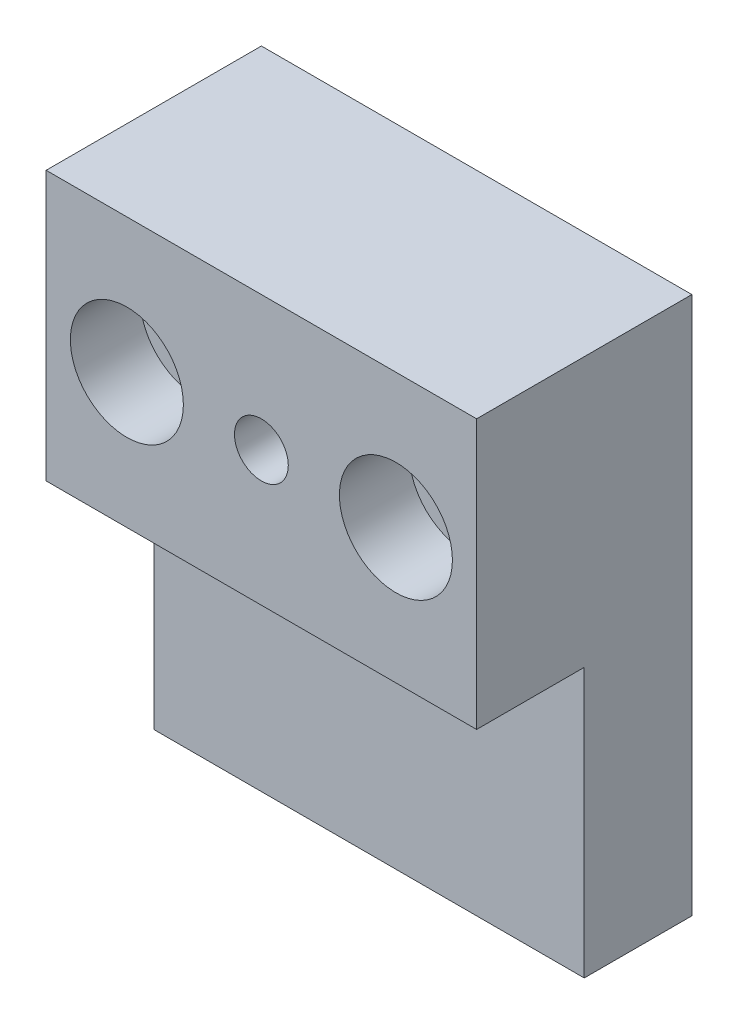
ISO-10303-21;
HEADER;
FILE_DESCRIPTION(('STEP AP214'),'2;1');
FILE_NAME('part.step','',(''),(''),'','','');
FILE_SCHEMA(('AUTOMOTIVE_DESIGN { 1 0 10303 214 1 1 1 1 }'));
ENDSEC;
DATA;
#1=APPLICATION_CONTEXT('core data for automotive mechanical design processes');
#2=APPLICATION_PROTOCOL_DEFINITION('international standard','automotive_design',2000,#1);
#3=PRODUCT_CONTEXT('',#1,'mechanical');
#4=PRODUCT('Part','Part','',(#3));
#5=PRODUCT_RELATED_PRODUCT_CATEGORY('part','',(#4));
#6=PRODUCT_DEFINITION_FORMATION('','',#4);
#7=PRODUCT_DEFINITION_CONTEXT('part definition',#1,'design');
#8=PRODUCT_DEFINITION('design','',#6,#7);
#9=PRODUCT_DEFINITION_SHAPE('','',#8);
#10=(LENGTH_UNIT() NAMED_UNIT(*) SI_UNIT(.MILLI.,.METRE.));
#11=(NAMED_UNIT(*) PLANE_ANGLE_UNIT() SI_UNIT($,.RADIAN.));
#12=(NAMED_UNIT(*) SI_UNIT($,.STERADIAN.) SOLID_ANGLE_UNIT());
#13=UNCERTAINTY_MEASURE_WITH_UNIT(LENGTH_MEASURE(1.E-05),#10,'distance_accuracy_value','');
#14=(GEOMETRIC_REPRESENTATION_CONTEXT(3) GLOBAL_UNCERTAINTY_ASSIGNED_CONTEXT((#13)) GLOBAL_UNIT_ASSIGNED_CONTEXT((#10,
#11,#12)) REPRESENTATION_CONTEXT('',''));
#15=CARTESIAN_POINT('',(0.,0.,0.));
#16=DIRECTION('',(0.,0.,1.));
#17=DIRECTION('',(1.,0.,0.));
#18=AXIS2_PLACEMENT_3D('',#15,#16,#17);
#19=CARTESIAN_POINT('',(7.5,37.5,20.));
#20=DIRECTION('',(0.,0.,1.));
#21=DIRECTION('',(1.,0.,0.));
#22=AXIS2_PLACEMENT_3D('',#19,#20,#21);
#23=CYLINDRICAL_SURFACE('',#22,3.25);
#24=CARTESIAN_POINT('',(7.5,37.5,13.5));
#25=DIRECTION('',(0.,0.,1.));
#26=DIRECTION('',(1.,0.,0.));
#27=AXIS2_PLACEMENT_3D('',#24,#25,#26);
#28=CIRCLE('',#27,3.25);
#29=CARTESIAN_POINT('',(10.75,37.5,13.5));
#30=VERTEX_POINT('',#29);
#31=EDGE_CURVE('E142',#30,#30,#28,.T.);
#32=ORIENTED_EDGE('',*,*,#31,.T.);
#33=EDGE_LOOP('',(#32));
#34=FACE_BOUND('',#33,.T.);
#35=CARTESIAN_POINT('',(7.5,37.5,5.));
#36=DIRECTION('',(0.,0.,-1.));
#37=DIRECTION('',(-1.,0.,0.));
#38=AXIS2_PLACEMENT_3D('',#35,#36,#37);
#39=CIRCLE('',#38,3.25);
#40=CARTESIAN_POINT('',(4.25,37.5,5.));
#41=VERTEX_POINT('',#40);
#42=EDGE_CURVE('E46',#41,#41,#39,.F.);
#43=ORIENTED_EDGE('',*,*,#42,.F.);
#44=EDGE_LOOP('',(#43));
#45=FACE_BOUND('',#44,.T.);
#46=ADVANCED_FACE('F42',(#34,#45),#23,.F.);
#47=CARTESIAN_POINT('',(32.5,37.5,20.));
#48=DIRECTION('',(0.,0.,1.));
#49=DIRECTION('',(1.,0.,0.));
#50=AXIS2_PLACEMENT_3D('',#47,#48,#49);
#51=CYLINDRICAL_SURFACE('',#50,3.25);
#52=CARTESIAN_POINT('',(32.5,37.5,13.5));
#53=DIRECTION('',(0.,0.,1.));
#54=DIRECTION('',(1.,0.,0.));
#55=AXIS2_PLACEMENT_3D('',#52,#53,#54);
#56=CIRCLE('',#55,3.25);
#57=CARTESIAN_POINT('',(35.75,37.5,13.5));
#58=VERTEX_POINT('',#57);
#59=EDGE_CURVE('E151',#58,#58,#56,.T.);
#60=ORIENTED_EDGE('',*,*,#59,.T.);
#61=EDGE_LOOP('',(#60));
#62=FACE_BOUND('',#61,.T.);
#63=CARTESIAN_POINT('',(32.5,37.5,5.));
#64=DIRECTION('',(0.,0.,-1.));
#65=DIRECTION('',(-1.,0.,0.));
#66=AXIS2_PLACEMENT_3D('',#63,#64,#65);
#67=CIRCLE('',#66,3.25);
#68=CARTESIAN_POINT('',(29.25,37.5,5.));
#69=VERTEX_POINT('',#68);
#70=EDGE_CURVE('E120',#69,#69,#67,.F.);
#71=ORIENTED_EDGE('',*,*,#70,.F.);
#72=EDGE_LOOP('',(#71));
#73=FACE_BOUND('',#72,.T.);
#74=ADVANCED_FACE('F209',(#62,#73),#51,.F.);
#75=CARTESIAN_POINT('',(0.,50.,0.));
#76=DIRECTION('',(0.,0.,-1.));
#77=DIRECTION('',(-1.,0.,0.));
#78=AXIS2_PLACEMENT_3D('',#75,#76,#77);
#79=PLANE('',#78);
#80=CARTESIAN_POINT('',(7.5,37.5,0.));
#81=DIRECTION('',(0.,0.,-1.));
#82=DIRECTION('',(-1.,0.,0.));
#83=AXIS2_PLACEMENT_3D('',#80,#81,#82);
#84=CIRCLE('',#83,6.);
#85=CARTESIAN_POINT('',(1.5,37.5,0.));
#86=VERTEX_POINT('',#85);
#87=EDGE_CURVE('E137',#86,#86,#84,.T.);
#88=ORIENTED_EDGE('',*,*,#87,.F.);
#89=EDGE_LOOP('',(#88));
#90=FACE_BOUND('',#89,.T.);
#91=CARTESIAN_POINT('',(32.5,37.5,0.));
#92=DIRECTION('',(0.,0.,-1.));
#93=DIRECTION('',(-1.,0.,0.));
#94=AXIS2_PLACEMENT_3D('',#91,#92,#93);
#95=CIRCLE('',#94,6.);
#96=CARTESIAN_POINT('',(26.5,37.5,0.));
#97=VERTEX_POINT('',#96);
#98=EDGE_CURVE('E130',#97,#97,#95,.T.);
#99=ORIENTED_EDGE('',*,*,#98,.F.);
#100=EDGE_LOOP('',(#99));
#101=FACE_BOUND('',#100,.T.);
#102=DIRECTION('',(0.,-1.,0.));
#103=VECTOR('',#102,1.);
#104=CARTESIAN_POINT('',(0.,0.,0.));
#105=LINE('',#104,#103);
#106=CARTESIAN_POINT('',(0.,50.,0.));
#107=VERTEX_POINT('',#106);
#108=CARTESIAN_POINT('',(0.,0.,0.));
#109=VERTEX_POINT('',#108);
#110=EDGE_CURVE('E103',#107,#109,#105,.T.);
#111=ORIENTED_EDGE('',*,*,#110,.F.);
#112=DIRECTION('',(-1.,0.,0.));
#113=VECTOR('',#112,1.);
#114=CARTESIAN_POINT('',(0.,50.,0.));
#115=LINE('',#114,#113);
#116=CARTESIAN_POINT('',(40.,50.,0.));
#117=VERTEX_POINT('',#116);
#118=EDGE_CURVE('E86',#117,#107,#115,.T.);
#119=ORIENTED_EDGE('',*,*,#118,.F.);
#120=DIRECTION('',(0.,1.,0.));
#121=VECTOR('',#120,1.);
#122=CARTESIAN_POINT('',(40.,0.,0.));
#123=LINE('',#122,#121);
#124=CARTESIAN_POINT('',(40.,0.,0.));
#125=VERTEX_POINT('',#124);
#126=EDGE_CURVE('E97',#125,#117,#123,.T.);
#127=ORIENTED_EDGE('',*,*,#126,.F.);
#128=DIRECTION('',(1.,0.,0.));
#129=VECTOR('',#128,1.);
#130=CARTESIAN_POINT('',(0.,0.,0.));
#131=LINE('',#130,#129);
#132=EDGE_CURVE('E110',#109,#125,#131,.T.);
#133=ORIENTED_EDGE('',*,*,#132,.F.);
#134=EDGE_LOOP('',(#111,#119,#127,#133));
#135=FACE_BOUND('',#134,.T.);
#136=CARTESIAN_POINT('',(20.,37.5,0.));
#137=DIRECTION('',(0.,0.,1.));
#138=DIRECTION('',(1.,0.,0.));
#139=AXIS2_PLACEMENT_3D('',#136,#137,#138);
#140=CIRCLE('',#139,2.5);
#141=CARTESIAN_POINT('',(22.5,37.5,0.));
#142=VERTEX_POINT('',#141);
#143=EDGE_CURVE('E122',#142,#142,#140,.T.);
#144=ORIENTED_EDGE('',*,*,#143,.T.);
#145=EDGE_LOOP('',(#144));
#146=FACE_BOUND('',#145,.T.);
#147=ADVANCED_FACE('F107',(#90,#101,#135,#146),#79,.T.);
#148=CARTESIAN_POINT('',(0.,0.,20.));
#149=DIRECTION('',(1.,0.,0.));
#150=DIRECTION('',(0.,0.,-1.));
#151=AXIS2_PLACEMENT_3D('',#148,#149,#150);
#152=PLANE('',#151);
#153=DIRECTION('',(0.,-1.,0.));
#154=VECTOR('',#153,1.);
#155=CARTESIAN_POINT('',(0.,0.,10.));
#156=LINE('',#155,#154);
#157=CARTESIAN_POINT('',(0.,25.,10.));
#158=VERTEX_POINT('',#157);
#159=CARTESIAN_POINT('',(0.,0.,10.));
#160=VERTEX_POINT('',#159);
#161=EDGE_CURVE('E161',#158,#160,#156,.T.);
#162=ORIENTED_EDGE('',*,*,#161,.F.);
#163=DIRECTION('',(0.,0.,1.));
#164=VECTOR('',#163,1.);
#165=CARTESIAN_POINT('',(0.,25.,10.));
#166=LINE('',#165,#164);
#167=CARTESIAN_POINT('',(0.,25.,20.));
#168=VERTEX_POINT('',#167);
#169=EDGE_CURVE('E111',#158,#168,#166,.T.);
#170=ORIENTED_EDGE('',*,*,#169,.T.);
#171=DIRECTION('',(0.,-1.,0.));
#172=VECTOR('',#171,1.);
#173=CARTESIAN_POINT('',(0.,0.,20.));
#174=LINE('',#173,#172);
#175=CARTESIAN_POINT('',(0.,50.,20.));
#176=VERTEX_POINT('',#175);
#177=EDGE_CURVE('E96',#176,#168,#174,.T.);
#178=ORIENTED_EDGE('',*,*,#177,.F.);
#179=DIRECTION('',(0.,0.,-1.));
#180=VECTOR('',#179,1.);
#181=CARTESIAN_POINT('',(0.,50.,20.));
#182=LINE('',#181,#180);
#183=EDGE_CURVE('E89',#176,#107,#182,.T.);
#184=ORIENTED_EDGE('',*,*,#183,.T.);
#185=ORIENTED_EDGE('',*,*,#110,.T.);
#186=DIRECTION('',(0.,0.,-1.));
#187=VECTOR('',#186,1.);
#188=CARTESIAN_POINT('',(0.,0.,20.));
#189=LINE('',#188,#187);
#190=EDGE_CURVE('E13',#160,#109,#189,.T.);
#191=ORIENTED_EDGE('',*,*,#190,.F.);
#192=EDGE_LOOP('',(#162,#170,#178,#184,#185,#191));
#193=FACE_BOUND('',#192,.T.);
#194=ADVANCED_FACE('F44',(#193),#152,.F.);
#195=CARTESIAN_POINT('',(0.,0.,20.));
#196=DIRECTION('',(0.,1.,0.));
#197=DIRECTION('',(0.,0.,1.));
#198=AXIS2_PLACEMENT_3D('',#195,#196,#197);
#199=PLANE('',#198);
#200=DIRECTION('',(0.,0.,-1.));
#201=VECTOR('',#200,1.);
#202=CARTESIAN_POINT('',(40.,0.,20.));
#203=LINE('',#202,#201);
#204=CARTESIAN_POINT('',(40.,0.,10.));
#205=VERTEX_POINT('',#204);
#206=EDGE_CURVE('E51',#205,#125,#203,.T.);
#207=ORIENTED_EDGE('',*,*,#206,.F.);
#208=DIRECTION('',(1.,0.,0.));
#209=VECTOR('',#208,1.);
#210=CARTESIAN_POINT('',(0.,0.,10.));
#211=LINE('',#210,#209);
#212=EDGE_CURVE('E164',#160,#205,#211,.T.);
#213=ORIENTED_EDGE('',*,*,#212,.F.);
#214=ORIENTED_EDGE('',*,*,#190,.T.);
#215=ORIENTED_EDGE('',*,*,#132,.T.);
#216=EDGE_LOOP('',(#207,#213,#214,#215));
#217=FACE_BOUND('',#216,.T.);
#218=ADVANCED_FACE('F185',(#217),#199,.F.);
#219=CARTESIAN_POINT('',(40.,0.,20.));
#220=DIRECTION('',(-1.,0.,0.));
#221=DIRECTION('',(0.,0.,1.));
#222=AXIS2_PLACEMENT_3D('',#219,#220,#221);
#223=PLANE('',#222);
#224=DIRECTION('',(0.,1.,0.));
#225=VECTOR('',#224,1.);
#226=CARTESIAN_POINT('',(40.,0.,20.));
#227=LINE('',#226,#225);
#228=CARTESIAN_POINT('',(40.,25.,20.));
#229=VERTEX_POINT('',#228);
#230=CARTESIAN_POINT('',(40.,50.,20.));
#231=VERTEX_POINT('',#230);
#232=EDGE_CURVE('E175',#229,#231,#227,.T.);
#233=ORIENTED_EDGE('',*,*,#232,.F.);
#234=DIRECTION('',(0.,0.,1.));
#235=VECTOR('',#234,1.);
#236=CARTESIAN_POINT('',(40.,25.,10.));
#237=LINE('',#236,#235);
#238=CARTESIAN_POINT('',(40.,25.,10.));
#239=VERTEX_POINT('',#238);
#240=EDGE_CURVE('E59',#239,#229,#237,.T.);
#241=ORIENTED_EDGE('',*,*,#240,.F.);
#242=DIRECTION('',(0.,1.,0.));
#243=VECTOR('',#242,1.);
#244=CARTESIAN_POINT('',(40.,0.,10.));
#245=LINE('',#244,#243);
#246=EDGE_CURVE('E167',#205,#239,#245,.T.);
#247=ORIENTED_EDGE('',*,*,#246,.F.);
#248=ORIENTED_EDGE('',*,*,#206,.T.);
#249=ORIENTED_EDGE('',*,*,#126,.T.);
#250=DIRECTION('',(0.,0.,-1.));
#251=VECTOR('',#250,1.);
#252=CARTESIAN_POINT('',(40.,50.,20.));
#253=LINE('',#252,#251);
#254=EDGE_CURVE('E92',#231,#117,#253,.T.);
#255=ORIENTED_EDGE('',*,*,#254,.F.);
#256=EDGE_LOOP('',(#233,#241,#247,#248,#249,#255));
#257=FACE_BOUND('',#256,.T.);
#258=ADVANCED_FACE('F179',(#257),#223,.F.);
#259=CARTESIAN_POINT('',(0.,50.,20.));
#260=DIRECTION('',(0.,-1.,0.));
#261=DIRECTION('',(0.,0.,-1.));
#262=AXIS2_PLACEMENT_3D('',#259,#260,#261);
#263=PLANE('',#262);
#264=ORIENTED_EDGE('',*,*,#118,.T.);
#265=ORIENTED_EDGE('',*,*,#183,.F.);
#266=DIRECTION('',(-1.,0.,0.));
#267=VECTOR('',#266,1.);
#268=CARTESIAN_POINT('',(0.,50.,20.));
#269=LINE('',#268,#267);
#270=EDGE_CURVE('E68',#231,#176,#269,.T.);
#271=ORIENTED_EDGE('',*,*,#270,.F.);
#272=ORIENTED_EDGE('',*,*,#254,.T.);
#273=EDGE_LOOP('',(#264,#265,#271,#272));
#274=FACE_BOUND('',#273,.T.);
#275=ADVANCED_FACE('F88',(#274),#263,.F.);
#276=CARTESIAN_POINT('',(0.,50.,20.));
#277=DIRECTION('',(0.,0.,-1.));
#278=DIRECTION('',(-1.,0.,0.));
#279=AXIS2_PLACEMENT_3D('',#276,#277,#278);
#280=PLANE('',#279);
#281=CARTESIAN_POINT('',(20.,37.5,20.));
#282=DIRECTION('',(0.,0.,1.));
#283=DIRECTION('',(1.,0.,0.));
#284=AXIS2_PLACEMENT_3D('',#281,#282,#283);
#285=CIRCLE('',#284,2.49999999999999);
#286=CARTESIAN_POINT('',(22.5,37.5,20.));
#287=VERTEX_POINT('',#286);
#288=EDGE_CURVE('E127',#287,#287,#285,.T.);
#289=ORIENTED_EDGE('',*,*,#288,.F.);
#290=EDGE_LOOP('',(#289));
#291=FACE_BOUND('',#290,.T.);
#292=CARTESIAN_POINT('',(7.5,37.5,20.));
#293=DIRECTION('',(0.,0.,1.));
#294=DIRECTION('',(1.,0.,0.));
#295=AXIS2_PLACEMENT_3D('',#292,#293,#294);
#296=CIRCLE('',#295,5.25);
#297=CARTESIAN_POINT('',(12.75,37.5,20.));
#298=VERTEX_POINT('',#297);
#299=EDGE_CURVE('E148',#298,#298,#296,.T.);
#300=ORIENTED_EDGE('',*,*,#299,.F.);
#301=EDGE_LOOP('',(#300));
#302=FACE_BOUND('',#301,.T.);
#303=CARTESIAN_POINT('',(32.5,37.5,20.));
#304=DIRECTION('',(0.,0.,1.));
#305=DIRECTION('',(1.,0.,0.));
#306=AXIS2_PLACEMENT_3D('',#303,#304,#305);
#307=CIRCLE('',#306,5.25);
#308=CARTESIAN_POINT('',(37.75,37.5,20.));
#309=VERTEX_POINT('',#308);
#310=EDGE_CURVE('E157',#309,#309,#307,.T.);
#311=ORIENTED_EDGE('',*,*,#310,.F.);
#312=EDGE_LOOP('',(#311));
#313=FACE_BOUND('',#312,.T.);
#314=ORIENTED_EDGE('',*,*,#177,.T.);
#315=DIRECTION('',(-1.,0.,0.));
#316=VECTOR('',#315,1.);
#317=CARTESIAN_POINT('',(0.,25.,20.));
#318=LINE('',#317,#316);
#319=EDGE_CURVE('E160',#229,#168,#318,.T.);
#320=ORIENTED_EDGE('',*,*,#319,.F.);
#321=ORIENTED_EDGE('',*,*,#232,.T.);
#322=ORIENTED_EDGE('',*,*,#270,.T.);
#323=EDGE_LOOP('',(#314,#320,#321,#322));
#324=FACE_BOUND('',#323,.T.);
#325=ADVANCED_FACE('F177',(#291,#302,#313,#324),#280,.F.);
#326=CARTESIAN_POINT('',(0.,25.,10.));
#327=DIRECTION('',(0.,1.,0.));
#328=DIRECTION('',(0.,0.,1.));
#329=AXIS2_PLACEMENT_3D('',#326,#327,#328);
#330=PLANE('',#329);
#331=ORIENTED_EDGE('',*,*,#319,.T.);
#332=ORIENTED_EDGE('',*,*,#169,.F.);
#333=DIRECTION('',(-1.,0.,0.));
#334=VECTOR('',#333,1.);
#335=CARTESIAN_POINT('',(0.,25.,10.));
#336=LINE('',#335,#334);
#337=EDGE_CURVE('E170',#239,#158,#336,.T.);
#338=ORIENTED_EDGE('',*,*,#337,.F.);
#339=ORIENTED_EDGE('',*,*,#240,.T.);
#340=EDGE_LOOP('',(#331,#332,#338,#339));
#341=FACE_BOUND('',#340,.T.);
#342=ADVANCED_FACE('F195',(#341),#330,.F.);
#343=CARTESIAN_POINT('',(0.,25.,10.));
#344=DIRECTION('',(0.,0.,-1.));
#345=DIRECTION('',(-1.,0.,0.));
#346=AXIS2_PLACEMENT_3D('',#343,#344,#345);
#347=PLANE('',#346);
#348=ORIENTED_EDGE('',*,*,#161,.T.);
#349=ORIENTED_EDGE('',*,*,#212,.T.);
#350=ORIENTED_EDGE('',*,*,#246,.T.);
#351=ORIENTED_EDGE('',*,*,#337,.T.);
#352=EDGE_LOOP('',(#348,#349,#350,#351));
#353=FACE_BOUND('',#352,.T.);
#354=ADVANCED_FACE('F196',(#353),#347,.F.);
#355=CARTESIAN_POINT('',(32.5,37.5,20.));
#356=DIRECTION('',(0.,0.,1.));
#357=DIRECTION('',(1.,0.,0.));
#358=AXIS2_PLACEMENT_3D('',#355,#356,#357);
#359=CYLINDRICAL_SURFACE('',#358,5.25);
#360=CARTESIAN_POINT('',(32.5,37.5,13.5));
#361=DIRECTION('',(0.,0.,1.));
#362=DIRECTION('',(1.,0.,0.));
#363=AXIS2_PLACEMENT_3D('',#360,#361,#362);
#364=CIRCLE('',#363,5.25);
#365=CARTESIAN_POINT('',(37.75,37.5,13.5));
#366=VERTEX_POINT('',#365);
#367=EDGE_CURVE('E154',#366,#366,#364,.T.);
#368=ORIENTED_EDGE('',*,*,#367,.F.);
#369=EDGE_LOOP('',(#368));
#370=FACE_BOUND('',#369,.T.);
#371=ORIENTED_EDGE('',*,*,#310,.T.);
#372=EDGE_LOOP('',(#371));
#373=FACE_BOUND('',#372,.T.);
#374=ADVANCED_FACE('F198',(#370,#373),#359,.F.);
#375=CARTESIAN_POINT('',(35.75,37.5,13.5));
#376=DIRECTION('',(0.,0.,-1.));
#377=DIRECTION('',(-1.,0.,0.));
#378=AXIS2_PLACEMENT_3D('',#375,#376,#377);
#379=PLANE('',#378);
#380=ORIENTED_EDGE('',*,*,#59,.F.);
#381=EDGE_LOOP('',(#380));
#382=FACE_BOUND('',#381,.T.);
#383=ORIENTED_EDGE('',*,*,#367,.T.);
#384=EDGE_LOOP('',(#383));
#385=FACE_BOUND('',#384,.T.);
#386=ADVANCED_FACE('F204',(#382,#385),#379,.F.);
#387=CARTESIAN_POINT('',(7.5,37.5,20.));
#388=DIRECTION('',(0.,0.,1.));
#389=DIRECTION('',(1.,0.,0.));
#390=AXIS2_PLACEMENT_3D('',#387,#388,#389);
#391=CYLINDRICAL_SURFACE('',#390,5.25);
#392=CARTESIAN_POINT('',(7.5,37.5,13.5));
#393=DIRECTION('',(0.,0.,1.));
#394=DIRECTION('',(1.,0.,0.));
#395=AXIS2_PLACEMENT_3D('',#392,#393,#394);
#396=CIRCLE('',#395,5.25);
#397=CARTESIAN_POINT('',(12.75,37.5,13.5));
#398=VERTEX_POINT('',#397);
#399=EDGE_CURVE('E145',#398,#398,#396,.T.);
#400=ORIENTED_EDGE('',*,*,#399,.F.);
#401=EDGE_LOOP('',(#400));
#402=FACE_BOUND('',#401,.T.);
#403=ORIENTED_EDGE('',*,*,#299,.T.);
#404=EDGE_LOOP('',(#403));
#405=FACE_BOUND('',#404,.T.);
#406=ADVANCED_FACE('F225',(#402,#405),#391,.F.);
#407=CARTESIAN_POINT('',(10.75,37.5,13.5));
#408=DIRECTION('',(0.,0.,-1.));
#409=DIRECTION('',(-1.,0.,0.));
#410=AXIS2_PLACEMENT_3D('',#407,#408,#409);
#411=PLANE('',#410);
#412=ORIENTED_EDGE('',*,*,#31,.F.);
#413=EDGE_LOOP('',(#412));
#414=FACE_BOUND('',#413,.T.);
#415=ORIENTED_EDGE('',*,*,#399,.T.);
#416=EDGE_LOOP('',(#415));
#417=FACE_BOUND('',#416,.T.);
#418=ADVANCED_FACE('F222',(#414,#417),#411,.F.);
#419=CARTESIAN_POINT('',(20.,37.5,20.));
#420=DIRECTION('',(0.,0.,1.));
#421=DIRECTION('',(1.,0.,0.));
#422=AXIS2_PLACEMENT_3D('',#419,#420,#421);
#423=CYLINDRICAL_SURFACE('',#422,2.49999999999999);
#424=ORIENTED_EDGE('',*,*,#143,.F.);
#425=EDGE_LOOP('',(#424));
#426=FACE_BOUND('',#425,.T.);
#427=ORIENTED_EDGE('',*,*,#288,.T.);
#428=EDGE_LOOP('',(#427));
#429=FACE_BOUND('',#428,.T.);
#430=ADVANCED_FACE('F220',(#426,#429),#423,.F.);
#431=CARTESIAN_POINT('',(32.5,37.5,5.));
#432=DIRECTION('',(0.,0.,-1.));
#433=DIRECTION('',(-1.,0.,0.));
#434=AXIS2_PLACEMENT_3D('',#431,#432,#433);
#435=PLANE('',#434);
#436=CARTESIAN_POINT('',(32.5,37.5,5.));
#437=DIRECTION('',(0.,0.,-1.));
#438=DIRECTION('',(-1.,0.,0.));
#439=AXIS2_PLACEMENT_3D('',#436,#437,#438);
#440=CIRCLE('',#439,6.);
#441=CARTESIAN_POINT('',(26.5,37.5,5.));
#442=VERTEX_POINT('',#441);
#443=EDGE_CURVE('E123',#442,#442,#440,.T.);
#444=ORIENTED_EDGE('',*,*,#443,.T.);
#445=EDGE_LOOP('',(#444));
#446=FACE_BOUND('',#445,.T.);
#447=ORIENTED_EDGE('',*,*,#70,.T.);
#448=EDGE_LOOP('',(#447));
#449=FACE_BOUND('',#448,.T.);
#450=ADVANCED_FACE('F280',(#446,#449),#435,.T.);
#451=CARTESIAN_POINT('',(32.5,37.5,5.));
#452=DIRECTION('',(0.,0.,-1.));
#453=DIRECTION('',(-1.,0.,0.));
#454=AXIS2_PLACEMENT_3D('',#451,#452,#453);
#455=CYLINDRICAL_SURFACE('',#454,6.);
#456=ORIENTED_EDGE('',*,*,#443,.F.);
#457=EDGE_LOOP('',(#456));
#458=FACE_BOUND('',#457,.T.);
#459=ORIENTED_EDGE('',*,*,#98,.T.);
#460=EDGE_LOOP('',(#459));
#461=FACE_BOUND('',#460,.T.);
#462=ADVANCED_FACE('F284',(#458,#461),#455,.F.);
#463=CARTESIAN_POINT('',(7.5,37.5,5.));
#464=DIRECTION('',(0.,0.,-1.));
#465=DIRECTION('',(-1.,0.,0.));
#466=AXIS2_PLACEMENT_3D('',#463,#464,#465);
#467=PLANE('',#466);
#468=CARTESIAN_POINT('',(7.5,37.5,5.));
#469=DIRECTION('',(0.,0.,-1.));
#470=DIRECTION('',(-1.,0.,0.));
#471=AXIS2_PLACEMENT_3D('',#468,#469,#470);
#472=CIRCLE('',#471,6.);
#473=CARTESIAN_POINT('',(1.5,37.5,5.));
#474=VERTEX_POINT('',#473);
#475=EDGE_CURVE('E322',#474,#474,#472,.T.);
#476=ORIENTED_EDGE('',*,*,#475,.T.);
#477=EDGE_LOOP('',(#476));
#478=FACE_BOUND('',#477,.T.);
#479=ORIENTED_EDGE('',*,*,#42,.T.);
#480=EDGE_LOOP('',(#479));
#481=FACE_BOUND('',#480,.T.);
#482=ADVANCED_FACE('F292',(#478,#481),#467,.T.);
#483=CARTESIAN_POINT('',(7.5,37.5,5.));
#484=DIRECTION('',(0.,0.,-1.));
#485=DIRECTION('',(-1.,0.,0.));
#486=AXIS2_PLACEMENT_3D('',#483,#484,#485);
#487=CYLINDRICAL_SURFACE('',#486,6.);
#488=ORIENTED_EDGE('',*,*,#475,.F.);
#489=EDGE_LOOP('',(#488));
#490=FACE_BOUND('',#489,.T.);
#491=ORIENTED_EDGE('',*,*,#87,.T.);
#492=EDGE_LOOP('',(#491));
#493=FACE_BOUND('',#492,.T.);
#494=ADVANCED_FACE('F306',(#490,#493),#487,.F.);
#495=CLOSED_SHELL('',(#46,#74,#147,#194,#218,#258,#275,#325,#342,#354,#374,#386,#406,#418,#430,
#450,#462,#482,#494));
#496=MANIFOLD_SOLID_BREP('B2',#495);
#497=ADVANCED_BREP_SHAPE_REPRESENTATION('',(#18,#496),#14);
#498=SHAPE_DEFINITION_REPRESENTATION(#9,#497);
ENDSEC;
END-ISO-10303-21;
